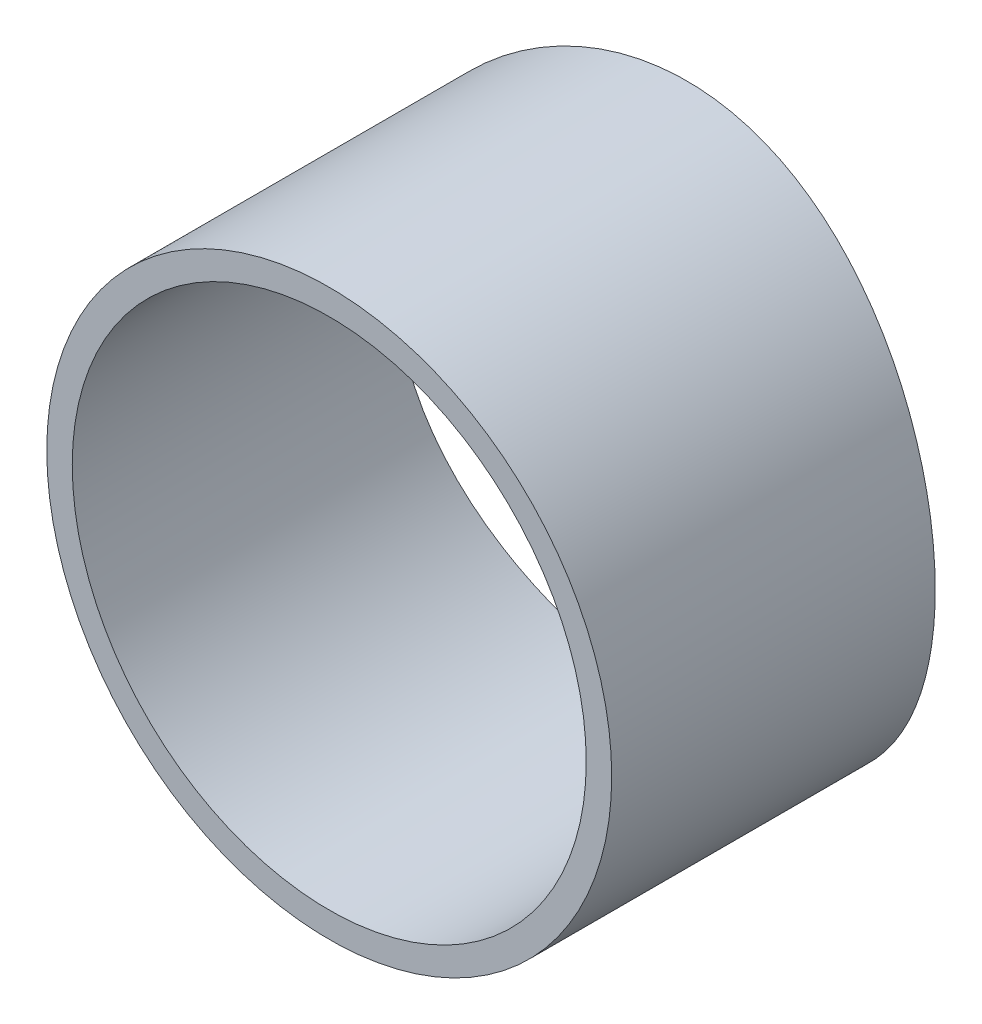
ISO-10303-21;
HEADER;
FILE_DESCRIPTION(('STEP AP214'),'2;1');
FILE_NAME('part.step','',(''),(''),'','','');
FILE_SCHEMA(('AUTOMOTIVE_DESIGN { 1 0 10303 214 1 1 1 1 }'));
ENDSEC;
DATA;
#1=APPLICATION_CONTEXT('core data for automotive mechanical design processes');
#2=APPLICATION_PROTOCOL_DEFINITION('international standard','automotive_design',2000,#1);
#3=PRODUCT_CONTEXT('',#1,'mechanical');
#4=PRODUCT('Part','Part','',(#3));
#5=PRODUCT_RELATED_PRODUCT_CATEGORY('part','',(#4));
#6=PRODUCT_DEFINITION_FORMATION('','',#4);
#7=PRODUCT_DEFINITION_CONTEXT('part definition',#1,'design');
#8=PRODUCT_DEFINITION('design','',#6,#7);
#9=PRODUCT_DEFINITION_SHAPE('','',#8);
#10=(LENGTH_UNIT() NAMED_UNIT(*) SI_UNIT(.MILLI.,.METRE.));
#11=(NAMED_UNIT(*) PLANE_ANGLE_UNIT() SI_UNIT($,.RADIAN.));
#12=(NAMED_UNIT(*) SI_UNIT($,.STERADIAN.) SOLID_ANGLE_UNIT());
#13=UNCERTAINTY_MEASURE_WITH_UNIT(LENGTH_MEASURE(1.E-05),#10,'distance_accuracy_value','');
#14=(GEOMETRIC_REPRESENTATION_CONTEXT(3) GLOBAL_UNCERTAINTY_ASSIGNED_CONTEXT((#13)) GLOBAL_UNIT_ASSIGNED_CONTEXT((#10,
#11,#12)) REPRESENTATION_CONTEXT('',''));
#15=CARTESIAN_POINT('',(0.,0.,0.));
#16=DIRECTION('',(0.,0.,1.));
#17=DIRECTION('',(1.,0.,0.));
#18=AXIS2_PLACEMENT_3D('',#15,#16,#17);
#19=CARTESIAN_POINT('',(400.,0.,-670.001));
#20=DIRECTION('',(0.,0.,1.));
#21=DIRECTION('',(1.,0.,0.));
#22=AXIS2_PLACEMENT_3D('',#19,#20,#21);
#23=CYLINDRICAL_SURFACE('',#22,69.8500000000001);
#24=CARTESIAN_POINT('',(400.,0.,0.));
#25=DIRECTION('',(0.,0.,1.));
#26=DIRECTION('',(1.,0.,0.));
#27=AXIS2_PLACEMENT_3D('',#24,#25,#26);
#28=CIRCLE('',#27,69.8500000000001);
#29=CARTESIAN_POINT('',(469.85,0.,0.));
#30=VERTEX_POINT('',#29);
#31=EDGE_CURVE('E11',#30,#30,#28,.T.);
#32=ORIENTED_EDGE('',*,*,#31,.F.);
#33=EDGE_LOOP('',(#32));
#34=FACE_BOUND('',#33,.T.);
#35=CARTESIAN_POINT('',(469.85,0.,-80.));
#36=CARTESIAN_POINT('',(469.849991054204,1.93305255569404,-80.0000047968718));
#37=CARTESIAN_POINT('',(469.769688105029,3.86629087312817,-80.0190478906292));
#38=CARTESIAN_POINT('',(469.449111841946,7.71886089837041,-80.0947052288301));
#39=CARTESIAN_POINT('',(469.208817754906,9.63819076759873,-80.1513243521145));
#40=CARTESIAN_POINT('',(468.570072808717,13.4500598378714,-80.3006006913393));
#41=CARTESIAN_POINT('',(468.171532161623,15.3425831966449,-80.3932783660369));
#42=CARTESIAN_POINT('',(467.219565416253,19.0861939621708,-80.6121042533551));
#43=CARTESIAN_POINT('',(466.666143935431,20.9372826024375,-80.7382514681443));
#44=CARTESIAN_POINT('',(465.40951872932,24.5831450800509,-81.0203944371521));
#45=CARTESIAN_POINT('',(464.706487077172,26.3779809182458,-81.1763558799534));
#46=CARTESIAN_POINT('',(463.155617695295,29.9014306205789,-81.5139916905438));
#47=CARTESIAN_POINT('',(462.307779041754,31.630044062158,-81.6956662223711));
#48=CARTESIAN_POINT('',(460.473517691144,35.0096075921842,-82.0798402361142));
#49=CARTESIAN_POINT('',(459.487098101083,36.6605594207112,-82.2823392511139));
#50=CARTESIAN_POINT('',(457.382575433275,39.874200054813,-82.7027629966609));
#51=CARTESIAN_POINT('',(456.264470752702,41.4368877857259,-82.9206879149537));
#52=CARTESIAN_POINT('',(453.884395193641,44.4893500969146,-83.3698961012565));
#53=CARTESIAN_POINT('',(452.620332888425,45.9774703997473,-83.601341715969));
#54=CARTESIAN_POINT('',(449.972434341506,48.8424331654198,-84.0678365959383));
#55=CARTESIAN_POINT('',(448.588596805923,50.2192744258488,-84.3028859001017));
#56=CARTESIAN_POINT('',(445.710166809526,52.8527061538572,-84.7701248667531));
#57=CARTESIAN_POINT('',(444.215563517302,54.1092848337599,-85.002314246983));
#58=CARTESIAN_POINT('',(441.125515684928,56.4935641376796,-85.4573422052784));
#59=CARTESIAN_POINT('',(439.530070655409,57.6212641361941,-85.6801807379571));
#60=CARTESIAN_POINT('',(436.227139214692,59.7539283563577,-86.1130531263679));
#61=CARTESIAN_POINT('',(434.518451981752,60.7570762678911,-86.3228791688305));
#62=CARTESIAN_POINT('',(431.019968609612,62.6155520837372,-86.7202813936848));
#63=CARTESIAN_POINT('',(429.230171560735,63.4708783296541,-86.9078573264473));
#64=CARTESIAN_POINT('',(425.582188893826,65.0269626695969,-87.2550955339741));
#65=CARTESIAN_POINT('',(423.724010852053,65.7277378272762,-87.4147608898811));
#66=CARTESIAN_POINT('',(419.952442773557,66.9691249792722,-87.7013007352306));
#67=CARTESIAN_POINT('',(418.03905391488,67.5097403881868,-87.8281759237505));
#68=CARTESIAN_POINT('',(414.206163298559,68.4179508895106,-88.0432123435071));
#69=CARTESIAN_POINT('',(412.28739782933,68.7884980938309,-88.1320321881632));
#70=CARTESIAN_POINT('',(408.424201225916,69.3676442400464,-88.2715240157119));
#71=CARTESIAN_POINT('',(406.479770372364,69.5762449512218,-88.3221964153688));
#72=CARTESIAN_POINT('',(402.579883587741,69.829682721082,-88.3838237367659));
#73=CARTESIAN_POINT('',(400.624429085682,69.8745405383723,-88.3947836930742));
#74=CARTESIAN_POINT('',(396.716843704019,69.8001571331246,-88.3766590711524));
#75=CARTESIAN_POINT('',(394.764712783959,69.680917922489,-88.3475749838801));
#76=CARTESIAN_POINT('',(390.920315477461,69.2837299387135,-88.2513204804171));
#77=CARTESIAN_POINT('',(389.027666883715,69.0092654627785,-88.1849864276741));
#78=CARTESIAN_POINT('',(385.27279224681,68.3065151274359,-88.0168117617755));
#79=CARTESIAN_POINT('',(383.410565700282,67.8782318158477,-87.9149717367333));
#80=CARTESIAN_POINT('',(379.729292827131,66.8712393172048,-87.6787434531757));
#81=CARTESIAN_POINT('',(377.910248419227,66.2925234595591,-87.5443537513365));
#82=CARTESIAN_POINT('',(374.327654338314,64.9891282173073,-87.2468772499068));
#83=CARTESIAN_POINT('',(372.56410545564,64.264446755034,-87.0837900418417));
#84=CARTESIAN_POINT('',(369.088234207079,62.6671916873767,-86.7318998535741));
#85=CARTESIAN_POINT('',(367.376528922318,61.7933243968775,-86.5428750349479));
#86=CARTESIAN_POINT('',(364.032590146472,59.9086930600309,-86.1455808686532));
#87=CARTESIAN_POINT('',(362.400356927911,58.8979285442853,-85.937311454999));
#88=CARTESIAN_POINT('',(359.225577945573,56.746335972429,-85.507242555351));
#89=CARTESIAN_POINT('',(357.683044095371,55.6054906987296,-85.2854412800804));
#90=CARTESIAN_POINT('',(354.697640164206,53.2014277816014,-84.8343517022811));
#91=CARTESIAN_POINT('',(353.254771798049,51.9382080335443,-84.6050632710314));
#92=CARTESIAN_POINT('',(350.442414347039,49.2638691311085,-84.1392780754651));
#93=CARTESIAN_POINT('',(349.075734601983,47.849799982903,-83.9027465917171));
#94=CARTESIAN_POINT('',(346.46601984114,44.9109941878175,-83.4348854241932));
#95=CARTESIAN_POINT('',(345.222986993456,43.3862556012,-83.2035558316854));
#96=CARTESIAN_POINT('',(342.869132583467,40.2362072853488,-82.7525385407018));
#97=CARTESIAN_POINT('',(341.758315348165,38.6108942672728,-82.5328512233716));
#98=CARTESIAN_POINT('',(339.676894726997,35.2706365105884,-82.1112575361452));
#99=CARTESIAN_POINT('',(338.706290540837,33.5556922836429,-81.9093510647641));
#100=CARTESIAN_POINT('',(336.909952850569,30.0428228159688,-81.5284366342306));
#101=CARTESIAN_POINT('',(336.084640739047,28.2446747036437,-81.3494956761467));
#102=CARTESIAN_POINT('',(334.588741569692,24.5825527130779,-81.0202770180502));
#103=CARTESIAN_POINT('',(333.918155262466,22.7185785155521,-80.8699994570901));
#104=CARTESIAN_POINT('',(332.737257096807,18.9384850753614,-80.6024403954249));
#105=CARTESIAN_POINT('',(332.226922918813,17.0223731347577,-80.4851542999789));
#106=CARTESIAN_POINT('',(331.370721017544,13.1519083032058,-80.2869502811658));
#107=CARTESIAN_POINT('',(331.024849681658,11.1975562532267,-80.2060315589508));
#108=CARTESIAN_POINT('',(330.506621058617,7.31077965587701,-80.0843419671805));
#109=CARTESIAN_POINT('',(330.330438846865,5.3788920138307,-80.0426865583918));
#110=CARTESIAN_POINT('',(330.139355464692,1.50672346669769,-79.9974942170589));
#111=CARTESIAN_POINT('',(330.124451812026,-0.433557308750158,-79.9939566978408));
#112=CARTESIAN_POINT('',(330.256043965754,-4.3081766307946,-80.0250978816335));
#113=CARTESIAN_POINT('',(330.402527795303,-6.24251560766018,-80.0597737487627));
#114=CARTESIAN_POINT('',(330.855637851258,-10.0912959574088,-80.1663656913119));
#115=CARTESIAN_POINT('',(331.162263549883,-12.0057373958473,-80.2382816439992));
#116=CARTESIAN_POINT('',(331.928033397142,-15.7759805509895,-80.4161688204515));
#117=CARTESIAN_POINT('',(332.385121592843,-17.6322221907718,-80.5216803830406));
#118=CARTESIAN_POINT('',(333.44915110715,-21.2990970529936,-80.7641679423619));
#119=CARTESIAN_POINT('',(334.056090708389,-23.1097307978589,-80.9011435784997));
#120=CARTESIAN_POINT('',(335.41523530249,-26.6733513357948,-81.2029092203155));
#121=CARTESIAN_POINT('',(336.167450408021,-28.4263341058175,-81.3677011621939));
#122=CARTESIAN_POINT('',(337.811596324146,-31.8630458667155,-81.7207291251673));
#123=CARTESIAN_POINT('',(338.703529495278,-33.5467736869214,-81.9089655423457));
#124=CARTESIAN_POINT('',(340.63642475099,-36.860926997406,-82.3071524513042));
#125=CARTESIAN_POINT('',(341.679575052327,-38.4900398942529,-82.5174063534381));
#126=CARTESIAN_POINT('',(343.896378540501,-41.6550011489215,-82.951352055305));
#127=CARTESIAN_POINT('',(345.070032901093,-43.1908486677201,-83.1750439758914));
#128=CARTESIAN_POINT('',(347.540088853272,-46.1596076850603,-83.6298806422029));
#129=CARTESIAN_POINT('',(348.836506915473,-47.5925053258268,-83.8610263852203));
#130=CARTESIAN_POINT('',(351.543452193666,-50.3459317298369,-84.3245164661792));
#131=CARTESIAN_POINT('',(352.953980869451,-51.6664590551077,-84.5568608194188));
#132=CARTESIAN_POINT('',(355.912079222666,-54.2141188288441,-85.0214786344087));
#133=CARTESIAN_POINT('',(357.461971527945,-55.4385767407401,-85.2536393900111));
#134=CARTESIAN_POINT('',(360.661049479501,-57.7526345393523,-85.7059909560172));
#135=CARTESIAN_POINT('',(362.310236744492,-58.8422322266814,-85.9261815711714));
#136=CARTESIAN_POINT('',(365.696728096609,-60.8786635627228,-86.3481853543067));
#137=CARTESIAN_POINT('',(367.434029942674,-61.8255008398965,-86.5499989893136));
#138=CARTESIAN_POINT('',(370.984851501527,-63.5692990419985,-86.9292779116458));
#139=CARTESIAN_POINT('',(372.798370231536,-64.3662618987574,-87.1067435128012));
#140=CARTESIAN_POINT('',(376.477904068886,-65.7997620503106,-87.4310021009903));
#141=CARTESIAN_POINT('',(378.343542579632,-66.4372257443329,-87.5779713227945));
#142=CARTESIAN_POINT('',(382.124235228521,-67.5526746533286,-87.8380865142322));
#143=CARTESIAN_POINT('',(384.039289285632,-68.0306601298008,-87.9512325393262));
#144=CARTESIAN_POINT('',(387.904455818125,-68.823044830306,-88.1401828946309));
#145=CARTESIAN_POINT('',(389.85456258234,-69.1374704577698,-88.2159932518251));
#146=CARTESIAN_POINT('',(393.775511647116,-69.6001074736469,-88.327919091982));
#147=CARTESIAN_POINT('',(395.7463535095,-69.7483223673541,-88.36403541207));
#148=CARTESIAN_POINT('',(399.643035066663,-69.8755825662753,-88.3950334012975));
#149=CARTESIAN_POINT('',(401.568728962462,-69.8588794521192,-88.3909513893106));
#150=CARTESIAN_POINT('',(405.41167113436,-69.6666164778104,-88.3441569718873));
#151=CARTESIAN_POINT('',(407.32891956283,-69.4910594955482,-88.3014452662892));
#152=CARTESIAN_POINT('',(411.141156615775,-68.982570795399,-88.1786738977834));
#153=CARTESIAN_POINT('',(413.036145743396,-68.649642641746,-88.0986150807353));
#154=CARTESIAN_POINT('',(416.790499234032,-67.8291514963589,-87.9035288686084));
#155=CARTESIAN_POINT('',(418.649863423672,-67.3415877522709,-87.7885013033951));
#156=CARTESIAN_POINT('',(422.311225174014,-66.2184336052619,-87.5274805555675));
#157=CARTESIAN_POINT('',(424.11345577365,-65.5835669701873,-87.381639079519));
#158=CARTESIAN_POINT('',(427.657795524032,-64.169381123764,-87.0628271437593));
#159=CARTESIAN_POINT('',(429.399905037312,-63.3900627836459,-86.8898568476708));
#160=CARTESIAN_POINT('',(432.812829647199,-61.6925724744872,-86.5216119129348));
#161=CARTESIAN_POINT('',(434.483637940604,-60.7743872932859,-86.3263351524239));
#162=CARTESIAN_POINT('',(437.743170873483,-58.8056197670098,-85.9188536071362));
#163=CARTESIAN_POINT('',(439.331893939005,-57.7550348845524,-85.7066484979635));
#164=CARTESIAN_POINT('',(442.45363600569,-55.5022787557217,-85.2659069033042));
#165=CARTESIAN_POINT('',(443.984462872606,-54.2971209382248,-85.0371035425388));
#166=CARTESIAN_POINT('',(446.939705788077,-51.7636425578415,-84.5741349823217));
#167=CARTESIAN_POINT('',(448.364120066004,-50.4353199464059,-84.339969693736));
#168=CARTESIAN_POINT('',(451.09750571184,-47.6639919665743,-83.8726765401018));
#169=CARTESIAN_POINT('',(452.406450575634,-46.2209604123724,-83.6395489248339));
#170=CARTESIAN_POINT('',(454.899788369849,-43.2299260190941,-83.1807712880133));
#171=CARTESIAN_POINT('',(456.084181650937,-41.6819234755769,-82.9551212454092));
#172=CARTESIAN_POINT('',(458.337985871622,-38.4658058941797,-82.5140052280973));
#173=CARTESIAN_POINT('',(459.405283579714,-36.7961791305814,-82.2987565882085));
#174=CARTESIAN_POINT('',(461.395183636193,-33.3703165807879,-81.8884210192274));
#175=CARTESIAN_POINT('',(462.317778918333,-31.6140765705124,-81.6933350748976));
#176=CARTESIAN_POINT('',(464.010556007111,-28.0285407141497,-81.3290178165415));
#177=CARTESIAN_POINT('',(464.780842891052,-26.1992962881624,-81.1597686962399));
#178=CARTESIAN_POINT('',(466.163564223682,-22.4797777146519,-80.8518404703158));
#179=CARTESIAN_POINT('',(466.776024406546,-20.5895135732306,-80.7131563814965));
#180=CARTESIAN_POINT('',(467.7278365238,-17.1592714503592,-80.4955507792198));
#181=CARTESIAN_POINT('',(468.097489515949,-15.6280274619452,-80.410199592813));
#182=CARTESIAN_POINT('',(468.732606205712,-12.5431440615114,-80.262739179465));
#183=CARTESIAN_POINT('',(468.998085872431,-10.9895081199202,-80.2006263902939));
#184=CARTESIAN_POINT('',(469.423432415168,-7.86714256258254,-80.1007838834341));
#185=CARTESIAN_POINT('',(469.583304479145,-6.29841369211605,-80.063052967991));
#186=CARTESIAN_POINT('',(469.796599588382,-3.15316513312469,-80.01265726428));
#187=CARTESIAN_POINT('',(469.850007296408,-1.5766443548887,-79.9999960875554));
#188=CARTESIAN_POINT('',(469.85,0.,-80.));
#189=B_SPLINE_CURVE_WITH_KNOTS('',3,(#35,#36,#37,#38,#39,#40,#41,#42,#43,#44,#45,#46,#47,#48,
#49,#50,#51,#52,#53,#54,#55,#56,#57,#58,#59,#60,#61,#62,#63,#64,#65,#66,#67,#68,#69,#70,#71,#72,
#73,#74,#75,#76,#77,#78,#79,#80,#81,#82,#83,#84,#85,#86,#87,#88,#89,#90,#91,#92,#93,#94,#95,#96,
#97,#98,#99,#100,#101,#102,#103,#104,#105,#106,#107,#108,#109,#110,#111,#112,#113,#114,#115,
#116,#117,#118,#119,#120,#121,#122,#123,#124,#125,#126,#127,#128,#129,#130,#131,#132,#133,#134,
#135,#136,#137,#138,#139,#140,#141,#142,#143,#144,#145,#146,#147,#148,#149,#150,#151,#152,#153,
#154,#155,#156,#157,#158,#159,#160,#161,#162,#163,#164,#165,#166,#167,#168,#169,#170,#171,#172,
#173,#174,#175,#176,#177,#178,#179,#180,#181,#182,#183,#184,#185,#186,#187,#188),.UNSPECIFIED.,
.T.,.F.,(4,2,2,2,2,2,2,2,2,2,2,2,2,2,2,2,2,2,2,2,2,2,2,2,2,2,2,2,2,2,2,2,2,2,2,2,2,2,2,2,2,2,2,
2,2,2,2,2,2,2,2,2,2,2,2,2,2,2,2,2,2,2,2,2,2,2,2,2,2,2,2,2,2,2,2,2,4),(0.,5.79772407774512,
11.5962010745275,17.3979727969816,23.1995715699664,28.9945333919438,34.7895321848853,
40.584401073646,46.3793405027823,52.2710929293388,58.1629090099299,64.0553019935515,
69.9477235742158,75.9179138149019,81.8881710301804,87.8577687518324,93.8272391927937,
99.6887573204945,105.550211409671,111.410922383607,117.271561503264,123.005591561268,
128.73952664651,134.473716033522,140.207987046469,145.994775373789,151.781583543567,
157.569158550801,163.356833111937,169.292091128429,175.227453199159,181.163009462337,
187.098531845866,193.050995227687,199.00348748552,204.955150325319,210.906682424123,
216.720684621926,222.534597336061,228.348078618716,234.161540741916,239.898653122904,
245.635699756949,251.373145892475,257.110688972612,262.941563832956,268.772491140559,
274.604201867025,280.435987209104,286.395328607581,292.354767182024,298.314054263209,
304.27326452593,310.197014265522,316.120754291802,322.043537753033,327.966196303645,
333.736575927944,339.506851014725,345.276995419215,351.047167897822,356.789567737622,
362.531932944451,368.27484483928,374.017866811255,379.896101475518,385.77443392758,
391.654112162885,397.533773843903,403.50636652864,409.479250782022,415.447999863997,
421.415775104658,426.144815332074,430.873130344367,435.601213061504,440.32997685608),.UNSPECIFIED.);
#190=CARTESIAN_POINT('',(469.85,0.,-80.));
#191=VERTEX_POINT('',#190);
#192=EDGE_CURVE('E58',#191,#191,#189,.T.);
#193=ORIENTED_EDGE('',*,*,#192,.T.);
#194=EDGE_LOOP('',(#193));
#195=FACE_BOUND('',#194,.T.);
#196=ADVANCED_FACE('F41',(#34,#195),#23,.T.);
#197=CARTESIAN_POINT('',(400.,0.,-670.001));
#198=DIRECTION('',(0.,0.,1.));
#199=DIRECTION('',(1.,0.,0.));
#200=AXIS2_PLACEMENT_3D('',#197,#198,#199);
#201=CYLINDRICAL_SURFACE('',#200,63.5500000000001);
#202=CARTESIAN_POINT('',(400.,0.,0.));
#203=DIRECTION('',(0.,0.,1.));
#204=DIRECTION('',(1.,0.,0.));
#205=AXIS2_PLACEMENT_3D('',#202,#203,#204);
#206=CIRCLE('',#205,63.5500000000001);
#207=CARTESIAN_POINT('',(463.55,0.,0.));
#208=VERTEX_POINT('',#207);
#209=EDGE_CURVE('E53',#208,#208,#206,.T.);
#210=ORIENTED_EDGE('',*,*,#209,.T.);
#211=EDGE_LOOP('',(#210));
#212=FACE_BOUND('',#211,.T.);
#213=CARTESIAN_POINT('',(463.55,0.,-80.));
#214=CARTESIAN_POINT('',(463.549990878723,1.76318033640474,-80.0000045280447));
#215=CARTESIAN_POINT('',(463.476558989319,3.52656012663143,-80.015847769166));
#216=CARTESIAN_POINT('',(463.183390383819,7.04071128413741,-80.0787930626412));
#217=CARTESIAN_POINT('',(462.963631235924,8.79148067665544,-80.1258999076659));
#218=CARTESIAN_POINT('',(462.379391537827,12.2688289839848,-80.2500984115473));
#219=CARTESIAN_POINT('',(462.014815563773,13.9953911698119,-80.3272098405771));
#220=CARTESIAN_POINT('',(461.143872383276,17.4107799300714,-80.5092709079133));
#221=CARTESIAN_POINT('',(460.637510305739,19.0996078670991,-80.6142195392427));
#222=CARTESIAN_POINT('',(459.487529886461,22.4261037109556,-80.8489377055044));
#223=CARTESIAN_POINT('',(458.844053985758,24.0638227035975,-80.9786814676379));
#224=CARTESIAN_POINT('',(457.424375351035,27.278775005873,-81.2595150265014));
#225=CARTESIAN_POINT('',(456.648171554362,28.856007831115,-81.4106049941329));
#226=CARTESIAN_POINT('',(454.96873428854,31.9393565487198,-81.7300220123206));
#227=CARTESIAN_POINT('',(454.065508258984,33.445476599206,-81.8983480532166));
#228=CARTESIAN_POINT('',(452.138333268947,36.3768267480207,-82.2477060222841));
#229=CARTESIAN_POINT('',(451.114383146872,37.802056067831,-82.4287380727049));
#230=CARTESIAN_POINT('',(448.937607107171,40.5816785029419,-82.8012297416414));
#231=CARTESIAN_POINT('',(447.783179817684,41.934802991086,-82.9927997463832));
#232=CARTESIAN_POINT('',(445.36523298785,44.539373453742,-83.3787081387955));
#233=CARTESIAN_POINT('',(444.101712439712,45.7908184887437,-83.5730465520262));
#234=CARTESIAN_POINT('',(441.473936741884,48.1837433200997,-83.9591159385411));
#235=CARTESIAN_POINT('',(440.109673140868,49.325213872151,-84.1508466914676));
#236=CARTESIAN_POINT('',(437.289577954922,51.4902905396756,-84.5263221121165));
#237=CARTESIAN_POINT('',(435.833746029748,52.5138962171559,-84.7100667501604));
#238=CARTESIAN_POINT('',(432.824154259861,54.4463912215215,-85.0662720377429));
#239=CARTESIAN_POINT('',(431.269511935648,55.3539331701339,-85.2385906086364));
#240=CARTESIAN_POINT('',(428.087290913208,57.0345891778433,-85.5647070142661));
#241=CARTESIAN_POINT('',(426.459711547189,57.8077020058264,-85.7185046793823));
#242=CARTESIAN_POINT('',(423.143194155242,59.2135001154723,-86.0029826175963));
#243=CARTESIAN_POINT('',(421.454261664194,59.8461980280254,-86.1336649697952));
#244=CARTESIAN_POINT('',(418.02703211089,60.9662079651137,-86.3679691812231));
#245=CARTESIAN_POINT('',(416.288735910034,61.4535225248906,-86.4715915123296));
#246=CARTESIAN_POINT('',(412.802080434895,62.272526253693,-86.647255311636));
#247=CARTESIAN_POINT('',(411.054270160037,62.6064558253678,-86.7197503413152));
#248=CARTESIAN_POINT('',(407.535796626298,63.1266719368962,-86.8332177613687));
#249=CARTESIAN_POINT('',(405.765133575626,63.3129598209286,-86.874190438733));
#250=CARTESIAN_POINT('',(402.214151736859,63.5363247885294,-86.9233633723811));
#251=CARTESIAN_POINT('',(400.433833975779,63.5734174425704,-86.931567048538));
#252=CARTESIAN_POINT('',(396.876527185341,63.4981208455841,-86.9149602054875));
#253=CARTESIAN_POINT('',(395.099538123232,63.3857330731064,-86.8901500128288));
#254=CARTESIAN_POINT('',(391.593271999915,63.0157292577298,-86.808999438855));
#255=CARTESIAN_POINT('',(389.863706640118,62.7607139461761,-86.7532238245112));
#256=CARTESIAN_POINT('',(386.432639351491,62.1094057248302,-86.6121837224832));
#257=CARTESIAN_POINT('',(384.731137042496,61.7131147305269,-86.5269196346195));
#258=CARTESIAN_POINT('',(381.367920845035,60.7823387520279,-86.3293687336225));
#259=CARTESIAN_POINT('',(379.70620845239,60.2478485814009,-86.2170809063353));
#260=CARTESIAN_POINT('',(376.433912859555,59.0447372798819,-85.9686937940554));
#261=CARTESIAN_POINT('',(374.823330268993,58.3761145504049,-85.8325942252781));
#262=CARTESIAN_POINT('',(371.651798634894,56.9039720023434,-85.5392854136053));
#263=CARTESIAN_POINT('',(370.091329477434,56.09944941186,-85.3819211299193));
#264=CARTESIAN_POINT('',(367.043529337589,54.3649522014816,-85.0513303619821));
#265=CARTESIAN_POINT('',(365.55619857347,53.4349772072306,-84.8781038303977));
#266=CARTESIAN_POINT('',(362.664197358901,51.4559110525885,-84.5205686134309));
#267=CARTESIAN_POINT('',(361.259536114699,50.4068066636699,-84.3362586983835));
#268=CARTESIAN_POINT('',(358.542115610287,48.1966158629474,-83.961613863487));
#269=CARTESIAN_POINT('',(357.229357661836,47.035527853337,-83.7712788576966));
#270=CARTESIAN_POINT('',(354.677736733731,44.5835276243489,-83.3857325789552));
#271=CARTESIAN_POINT('',(353.441001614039,43.2904029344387,-83.190502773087));
#272=CARTESIAN_POINT('',(351.080614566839,40.6041035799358,-82.8046070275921));
#273=CARTESIAN_POINT('',(349.956964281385,39.2109274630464,-82.6139411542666));
#274=CARTESIAN_POINT('',(347.830548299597,36.3338765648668,-82.2425016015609));
#275=CARTESIAN_POINT('',(346.827785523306,34.8499995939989,-82.0617281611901));
#276=CARTESIAN_POINT('',(344.950362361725,31.8016374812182,-81.7151408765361));
#277=CARTESIAN_POINT('',(344.075701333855,30.2371527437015,-81.5493269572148));
#278=CARTESIAN_POINT('',(342.45929976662,27.0350397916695,-81.2370015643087));
#279=CARTESIAN_POINT('',(341.717834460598,25.3972686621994,-81.0905302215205));
#280=CARTESIAN_POINT('',(340.375737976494,22.063076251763,-80.8214528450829));
#281=CARTESIAN_POINT('',(339.775107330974,20.3666547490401,-80.69884690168));
#282=CARTESIAN_POINT('',(338.719535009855,16.9275547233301,-80.4810261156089));
#283=CARTESIAN_POINT('',(338.264576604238,15.1848815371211,-80.3858081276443));
#284=CARTESIAN_POINT('',(337.504001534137,11.6658879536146,-80.225494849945));
#285=CARTESIAN_POINT('',(337.198382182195,9.88956816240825,-80.1603990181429));
#286=CARTESIAN_POINT('',(336.743479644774,6.35102926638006,-80.0631652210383));
#287=CARTESIAN_POINT('',(336.591292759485,4.58919977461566,-80.030415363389));
#288=CARTESIAN_POINT('',(336.434255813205,1.05869228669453,-79.9966180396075));
#289=CARTESIAN_POINT('',(336.429403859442,-0.709985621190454,-79.9955701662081));
#290=CARTESIAN_POINT('',(336.567070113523,-4.24121390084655,-80.0252050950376));
#291=CARTESIAN_POINT('',(336.709579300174,-6.00376464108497,-80.0558859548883));
#292=CARTESIAN_POINT('',(337.140783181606,-9.51006641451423,-80.1481145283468));
#293=CARTESIAN_POINT('',(337.429477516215,-11.2538174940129,-80.2096621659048));
#294=CARTESIAN_POINT('',(338.146872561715,-14.6916192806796,-80.361093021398));
#295=CARTESIAN_POINT('',(338.574052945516,-16.3860012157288,-80.4506681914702));
#296=CARTESIAN_POINT('',(339.565894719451,-19.73238253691,-80.6559099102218));
#297=CARTESIAN_POINT('',(340.130554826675,-21.3843823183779,-80.7715762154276));
#298=CARTESIAN_POINT('',(341.393141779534,-24.6349129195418,-81.0258868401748));
#299=CARTESIAN_POINT('',(342.091076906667,-26.2334404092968,-81.1645325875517));
#300=CARTESIAN_POINT('',(343.6151077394,-29.3663237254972,-81.4610840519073));
#301=CARTESIAN_POINT('',(344.441205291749,-30.9006786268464,-81.6189900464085));
#302=CARTESIAN_POINT('',(346.228091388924,-33.9160468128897,-81.9521629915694));
#303=CARTESIAN_POINT('',(347.190593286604,-35.3960215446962,-82.1276408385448));
#304=CARTESIAN_POINT('',(349.23463063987,-38.2699526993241,-82.4893014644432));
#305=CARTESIAN_POINT('',(350.316167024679,-39.6639084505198,-82.6754843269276));
#306=CARTESIAN_POINT('',(352.591046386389,-42.3568254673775,-83.0535175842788));
#307=CARTESIAN_POINT('',(353.784401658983,-43.6557762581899,-83.2453686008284));
#308=CARTESIAN_POINT('',(356.274886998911,-46.1500055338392,-83.6294976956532));
#309=CARTESIAN_POINT('',(357.572018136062,-47.3452829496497,-83.821775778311));
#310=CARTESIAN_POINT('',(360.285592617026,-49.6446076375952,-84.2048901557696));
#311=CARTESIAN_POINT('',(361.703753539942,-50.746643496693,-84.3956393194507));
#312=CARTESIAN_POINT('',(364.629181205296,-52.8273566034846,-84.7666669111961));
#313=CARTESIAN_POINT('',(366.1364491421,-53.8060321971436,-84.9469451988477));
#314=CARTESIAN_POINT('',(369.229761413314,-55.6329154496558,-85.2917964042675));
#315=CARTESIAN_POINT('',(370.815803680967,-56.4811265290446,-85.4563697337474));
#316=CARTESIAN_POINT('',(374.055707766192,-58.0407480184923,-85.7649676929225));
#317=CARTESIAN_POINT('',(375.709568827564,-58.7521599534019,-85.9089925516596));
#318=CARTESIAN_POINT('',(379.063970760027,-60.0290564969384,-86.1714432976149));
#319=CARTESIAN_POINT('',(380.764196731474,-60.5953394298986,-86.2900086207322));
#320=CARTESIAN_POINT('',(384.208022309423,-61.5826641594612,-86.4989940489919));
#321=CARTESIAN_POINT('',(385.951621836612,-62.0037062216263,-86.5894142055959));
#322=CARTESIAN_POINT('',(389.469236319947,-62.6970387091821,-86.7393413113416));
#323=CARTESIAN_POINT('',(391.243247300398,-62.9693484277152,-86.7988522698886));
#324=CARTESIAN_POINT('',(394.808722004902,-63.3630007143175,-86.8851427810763));
#325=CARTESIAN_POINT('',(396.600185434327,-63.4843458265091,-86.9119228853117));
#326=CARTESIAN_POINT('',(400.149151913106,-63.5740841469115,-86.931713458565));
#327=CARTESIAN_POINT('',(401.90657138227,-63.5456597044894,-86.925426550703));
#328=CARTESIAN_POINT('',(405.412596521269,-63.343424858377,-86.8808905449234));
#329=CARTESIAN_POINT('',(407.161202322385,-63.1696166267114,-86.8426419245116));
#330=CARTESIAN_POINT('',(410.637054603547,-62.6780375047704,-86.7353182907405));
#331=CARTESIAN_POINT('',(412.364301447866,-62.3602690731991,-86.666243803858));
#332=CARTESIAN_POINT('',(415.785262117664,-61.5833151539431,-86.4993016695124));
#333=CARTESIAN_POINT('',(417.478975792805,-61.1241290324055,-86.4014338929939));
#334=CARTESIAN_POINT('',(420.815591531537,-60.0696667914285,-86.1801183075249));
#335=CARTESIAN_POINT('',(422.458642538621,-59.4748437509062,-86.056755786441));
#336=CARTESIAN_POINT('',(425.6886408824,-58.1527427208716,-85.7877712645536));
#337=CARTESIAN_POINT('',(427.275588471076,-57.4254653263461,-85.6421493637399));
#338=CARTESIAN_POINT('',(430.383023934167,-55.8436585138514,-85.3327168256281));
#339=CARTESIAN_POINT('',(431.903506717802,-54.9891193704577,-85.1689047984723));
#340=CARTESIAN_POINT('',(434.868039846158,-53.1587912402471,-84.8276215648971));
#341=CARTESIAN_POINT('',(436.312088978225,-52.1830003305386,-84.6501501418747));
#342=CARTESIAN_POINT('',(439.142029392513,-50.0964559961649,-84.2828027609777));
#343=CARTESIAN_POINT('',(440.526221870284,-48.983428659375,-84.0927516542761));
#344=CARTESIAN_POINT('',(443.196346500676,-46.6457590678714,-83.7087783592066));
#345=CARTESIAN_POINT('',(444.482277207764,-45.4211151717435,-83.514856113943));
#346=CARTESIAN_POINT('',(446.947582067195,-42.8681301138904,-83.1284698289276));
#347=CARTESIAN_POINT('',(448.126931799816,-41.539765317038,-82.9360061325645));
#348=CARTESIAN_POINT('',(450.370748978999,-38.7884170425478,-82.5578920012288));
#349=CARTESIAN_POINT('',(451.435217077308,-37.3654341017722,-82.3722415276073));
#350=CARTESIAN_POINT('',(453.454468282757,-34.4159311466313,-82.0106173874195));
#351=CARTESIAN_POINT('',(454.407711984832,-32.8883382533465,-81.8347939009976));
#352=CARTESIAN_POINT('',(456.181917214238,-29.7562458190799,-81.5003476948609));
#353=CARTESIAN_POINT('',(457.002871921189,-28.1517423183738,-81.3417258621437));
#354=CARTESIAN_POINT('',(458.505621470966,-24.8784184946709,-81.0463256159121));
#355=CARTESIAN_POINT('',(459.187522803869,-23.2096485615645,-80.9095305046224));
#356=CARTESIAN_POINT('',(460.407512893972,-19.8186843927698,-80.6615761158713));
#357=CARTESIAN_POINT('',(460.945627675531,-18.0964998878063,-80.5504121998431));
#358=CARTESIAN_POINT('',(461.764111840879,-15.0231419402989,-80.3797633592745));
#359=CARTESIAN_POINT('',(462.075339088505,-13.6804248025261,-80.3142737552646));
#360=CARTESIAN_POINT('',(462.609943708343,-10.9770335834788,-80.2011974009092));
#361=CARTESIAN_POINT('',(462.833335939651,-9.61636257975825,-80.1536076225));
#362=CARTESIAN_POINT('',(463.191202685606,-6.88289995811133,-80.0771372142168));
#363=CARTESIAN_POINT('',(463.325680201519,-5.51010875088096,-80.0482559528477));
#364=CARTESIAN_POINT('',(463.505089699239,-2.75825303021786,-80.0096840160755));
#365=CARTESIAN_POINT('',(463.550007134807,-1.37918753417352,-79.9999964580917));
#366=CARTESIAN_POINT('',(463.55,0.,-80.));
#367=B_SPLINE_CURVE_WITH_KNOTS('',3,(#213,#214,#215,#216,#217,#218,#219,#220,#221,#222,#223,
#224,#225,#226,#227,#228,#229,#230,#231,#232,#233,#234,#235,#236,#237,#238,#239,#240,#241,#242,
#243,#244,#245,#246,#247,#248,#249,#250,#251,#252,#253,#254,#255,#256,#257,#258,#259,#260,#261,
#262,#263,#264,#265,#266,#267,#268,#269,#270,#271,#272,#273,#274,#275,#276,#277,#278,#279,#280,
#281,#282,#283,#284,#285,#286,#287,#288,#289,#290,#291,#292,#293,#294,#295,#296,#297,#298,#299,
#300,#301,#302,#303,#304,#305,#306,#307,#308,#309,#310,#311,#312,#313,#314,#315,#316,#317,#318,
#319,#320,#321,#322,#323,#324,#325,#326,#327,#328,#329,#330,#331,#332,#333,#334,#335,#336,#337,
#338,#339,#340,#341,#342,#343,#344,#345,#346,#347,#348,#349,#350,#351,#352,#353,#354,#355,#356,
#357,#358,#359,#360,#361,#362,#363,#364,#365,#366),.UNSPECIFIED.,.T.,.F.,(4,2,2,2,2,2,2,2,2,2,2,
2,2,2,2,2,2,2,2,2,2,2,2,2,2,2,2,2,2,2,2,2,2,2,2,2,2,2,2,2,2,2,2,2,2,2,2,2,2,2,2,2,2,2,2,2,2,2,2,
2,2,2,2,2,2,2,2,2,2,2,2,2,2,2,2,2,4),(0.,5.28829160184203,10.577394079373,15.8699874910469,
21.1623894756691,26.4493200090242,31.7362928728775,37.0229562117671,42.3096704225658,
47.670282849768,53.030944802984,58.3920569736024,63.7531890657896,69.1717920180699,
74.5904445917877,80.0086095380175,85.4266799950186,90.7628771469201,96.0990257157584,
101.434617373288,106.770156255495,112.011435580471,117.252643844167,122.494048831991,
127.735516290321,133.017499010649,138.299497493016,143.582083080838,148.864744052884,
154.258223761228,159.651781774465,165.045470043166,170.439131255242,175.843812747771,
181.248514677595,186.652595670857,192.056579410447,197.356256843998,202.655866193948,
207.955151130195,213.254423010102,218.497384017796,223.740296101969,228.983534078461,
234.226847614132,239.543078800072,244.859351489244,250.176209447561,255.493122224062,
260.905025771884,266.317001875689,271.728836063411,277.140609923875,282.521942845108,
287.903265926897,293.28389079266,298.664424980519,303.931099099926,309.197694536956,
314.464200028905,319.730729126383,324.979917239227,330.229081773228,335.478647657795,
340.728296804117,346.081029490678,351.433840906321,356.787875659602,362.141880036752,
367.562888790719,372.984176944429,378.401297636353,383.817437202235,387.95419053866,
392.090243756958,396.226157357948,400.36274265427),.UNSPECIFIED.);
#368=CARTESIAN_POINT('',(463.55,0.,-80.));
#369=VERTEX_POINT('',#368);
#370=EDGE_CURVE('E46',#369,#369,#367,.T.);
#371=ORIENTED_EDGE('',*,*,#370,.F.);
#372=EDGE_LOOP('',(#371));
#373=FACE_BOUND('',#372,.T.);
#374=ADVANCED_FACE('F43',(#212,#373),#201,.F.);
#375=CARTESIAN_POINT('',(400.,0.,0.));
#376=DIRECTION('',(0.,0.,1.));
#377=DIRECTION('',(1.,0.,0.));
#378=AXIS2_PLACEMENT_3D('',#375,#376,#377);
#379=PLANE('',#378);
#380=ORIENTED_EDGE('',*,*,#209,.F.);
#381=EDGE_LOOP('',(#380));
#382=FACE_BOUND('',#381,.T.);
#383=ORIENTED_EDGE('',*,*,#31,.T.);
#384=EDGE_LOOP('',(#383));
#385=FACE_BOUND('',#384,.T.);
#386=ADVANCED_FACE('F68',(#382,#385),#379,.T.);
#387=CARTESIAN_POINT('',(540.,0.,-375.));
#388=DIRECTION('',(-1.,0.,0.));
#389=DIRECTION('',(0.,0.,1.));
#390=AXIS2_PLACEMENT_3D('',#387,#388,#389);
#391=CYLINDRICAL_SURFACE('',#390,295.);
#392=ORIENTED_EDGE('',*,*,#192,.F.);
#393=EDGE_LOOP('',(#392));
#394=FACE_BOUND('',#393,.T.);
#395=ORIENTED_EDGE('',*,*,#370,.T.);
#396=EDGE_LOOP('',(#395));
#397=FACE_BOUND('',#396,.T.);
#398=ADVANCED_FACE('F65',(#394,#397),#391,.F.);
#399=CLOSED_SHELL('',(#196,#374,#386,#398));
#400=MANIFOLD_SOLID_BREP('B2',#399);
#401=ADVANCED_BREP_SHAPE_REPRESENTATION('',(#18,#400),#14);
#402=SHAPE_DEFINITION_REPRESENTATION(#9,#401);
ENDSEC;
END-ISO-10303-21;
